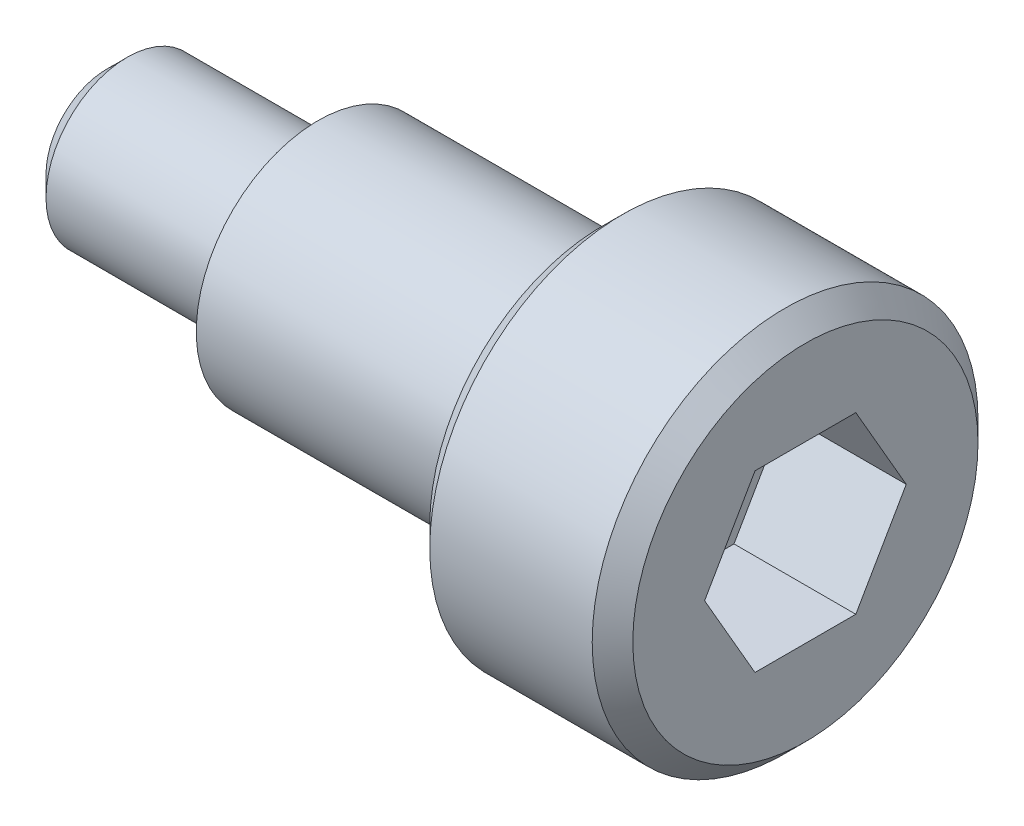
from build123d import *

# Parameters (mm, degrees)
CHAMFER1_SIZE      = 0.5
FILLET1_R          = 0.5
CUT_EXTRUDE1_DEPTH = 3


with BuildPart() as part:
    # Sketch1 → Revolve1 (revolve)
    with BuildSketch(Plane.XY, mode=Mode.PRIVATE) as revolve1_sk:
        Polygon((0, 0), (0, 4.75), (-5, 4.75), (-5, 3), (-12, 3), (-12, 2), (-17.2, 2), (-17.2, 0), align=None)
    revolve(revolve1_sk.sketch.rotate(Axis((0, 0, 0), (-1, 0, 0)), 90), axis=Axis((0, 0, 0), (-1, 0, 0)))

    # Chamfer1
    chamfer1_edges = [part.edges().sort_by_distance(p)[0] for p in [
        (-17.2, 0, 2),
        (-5, 0, 4.75),
        (0, 0, 4.75),
    ]]
    chamfer(chamfer1_edges, length=CHAMFER1_SIZE)

    # Fillet1
    fillet1_edges = [part.edges().sort_by_distance(p)[0] for p in [
        (-5, 0, 3),
    ]]
    fillet(fillet1_edges, radius=FILLET1_R)

    # Sketch2 → Cut-Extrude1 (cut)
    with BuildSketch(Plane(origin=(0, 0, 0), x_dir=(0, 0, -1), z_dir=(1, 0, 0))):
        Polygon((2.482606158, 0), (1.241303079, 2.15), (-1.241303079, 2.15), (-2.482606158, 0), (-1.241303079, -2.15), (1.241303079, -2.15), align=None)
    extrude(amount=-CUT_EXTRUDE1_DEPTH, mode=Mode.SUBTRACT)


solid = part.part
